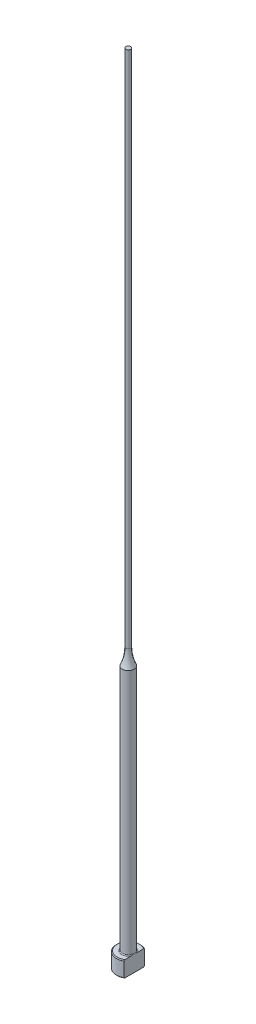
from build123d import *
from build123d.topology import SkipClean

# Parameters (mm, degrees)
CHAMFER1_SIZE    = 0.2
FILLET1_R        = 0.2
KEYED_HEAD_DEPTH = 201.044994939


with BuildPart() as part:
    # Sketch1 → Revolve1 (revolve)
    with BuildSketch(Plane.XY, mode=Mode.PRIVATE) as revolve1_sk:
        with BuildLine():
            Line((0, 0), (-3, 0))
            Line((-3, 0), (-3, 4))
            Line((-3, 4), (-1.5, 4))
            Line((-1.5, 4), (-1.5, 65.853917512))
            ThreePointArc((-1.5, 65.853917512), (-0.827589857, 67.878679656), (-0.6, 70))
            Line((-0.6, 70), (-0.6, 200))
            Line((-0.6, 200), (0, 200))
            Line((0, 200), (0, 0))
        make_face()
    revolve(revolve1_sk.sketch.rotate(Axis((0, 259.958771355, 0), (0, -1, 0)), 270), axis=Axis((0, 259.958771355, 0), (0, -1, 0)))

    # Chamfer1
    chamfer1_edges = [part.edges().sort_by_distance(p)[0] for p in [
        (0, 0, -3),
        (0, 4, -3),
    ]]
    chamfer(chamfer1_edges, length=CHAMFER1_SIZE)

    # Fillet1
    fillet1_edges = [part.edges().sort_by_distance(p)[0] for p in [
        (0, 4, -1.5),
    ]]
    fillet(fillet1_edges, radius=FILLET1_R)

    # Sketch2 → Keyed Head (cut, through all)
    with SkipClean():  # the faces are left unmerged after this step: merging them gives an invalid solid
        with BuildSketch(Plane(origin=(0, 0, 0), x_dir=(1, 0, 0), z_dir=(0, 1, 0))):
            with BuildLine():
                Line((1.5, -2.598076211), (1.5, 2.598076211))
                ThreePointArc((1.5, 2.598076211), (3, 0), (1.5, -2.598076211))
            make_face()
        extrude(amount=KEYED_HEAD_DEPTH, mode=Mode.SUBTRACT)


solid = part.part
